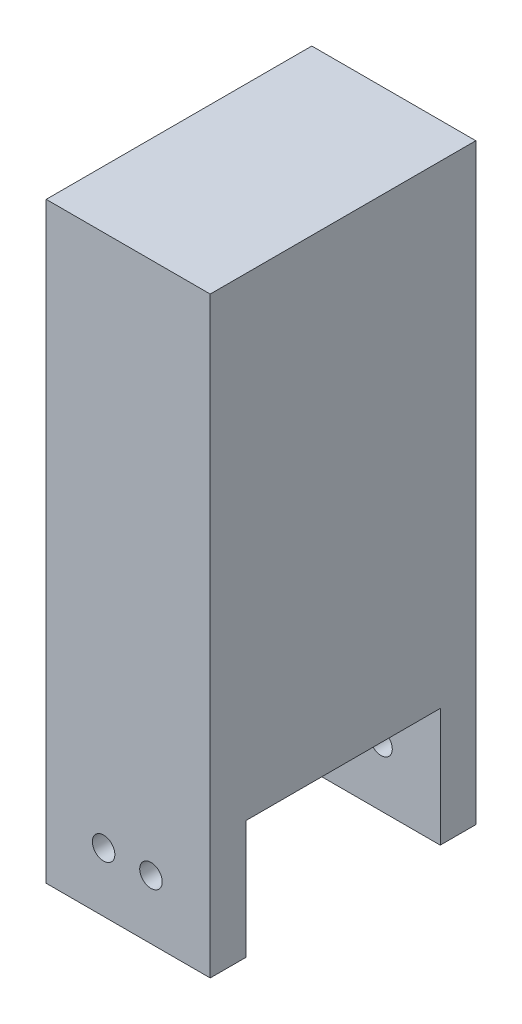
from build123d import *

# Parameters (mm, degrees)
SKETCH1_W           = 13.845651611
SKETCH1_H           = 50
SKETCH1_R           = 0.95
BOSS_EXTRUDE1_DEPTH = 3
BOSS_EXTRUDE2_REACH = 60.763
SKETCH2_W           = 13.845651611
SKETCH2_H           = 40


with BuildPart() as part:
    # Sketch1 → Boss-Extrude1 (new body)
    with BuildSketch(Plane.XY):
        with Locations((17.077174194, 25)):
            Rectangle(SKETCH1_W, SKETCH1_H)
        with Locations((19, 5)):
            Circle(SKETCH1_R, mode=Mode.SUBTRACT)
        with Locations((15, 5)):
            Circle(SKETCH1_R, mode=Mode.SUBTRACT)
    extrude(amount=BOSS_EXTRUDE1_DEPTH)


with BuildPart() as body_2:
    # Mirror2: mirrored copy
    add(part.part.mirror(Plane.XY.offset(-8.21)))

    # Sketch2 → Boss-Extrude2 (add, up to next)
    with BuildSketch(Plane(origin=(0, 0, 0), x_dir=(-1, 0, 0), z_dir=(0, 0, -1)), mode=Mode.PRIVATE) as boss_extrude2_sk1:
        with Locations((-17.077174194, 30)):
            Rectangle(SKETCH2_W, SKETCH2_H)
    boss_extrude2_tool1 = extrude(boss_extrude2_sk1.sketch, amount=BOSS_EXTRUDE2_REACH, mode=Mode.PRIVATE) - body_2.part

    add(part.part)  # Boss-Extrude2 merges part
    add(boss_extrude2_tool1.solids().sort_by_distance((17.077174, 30, 0))[0])


solid = body_2.part
